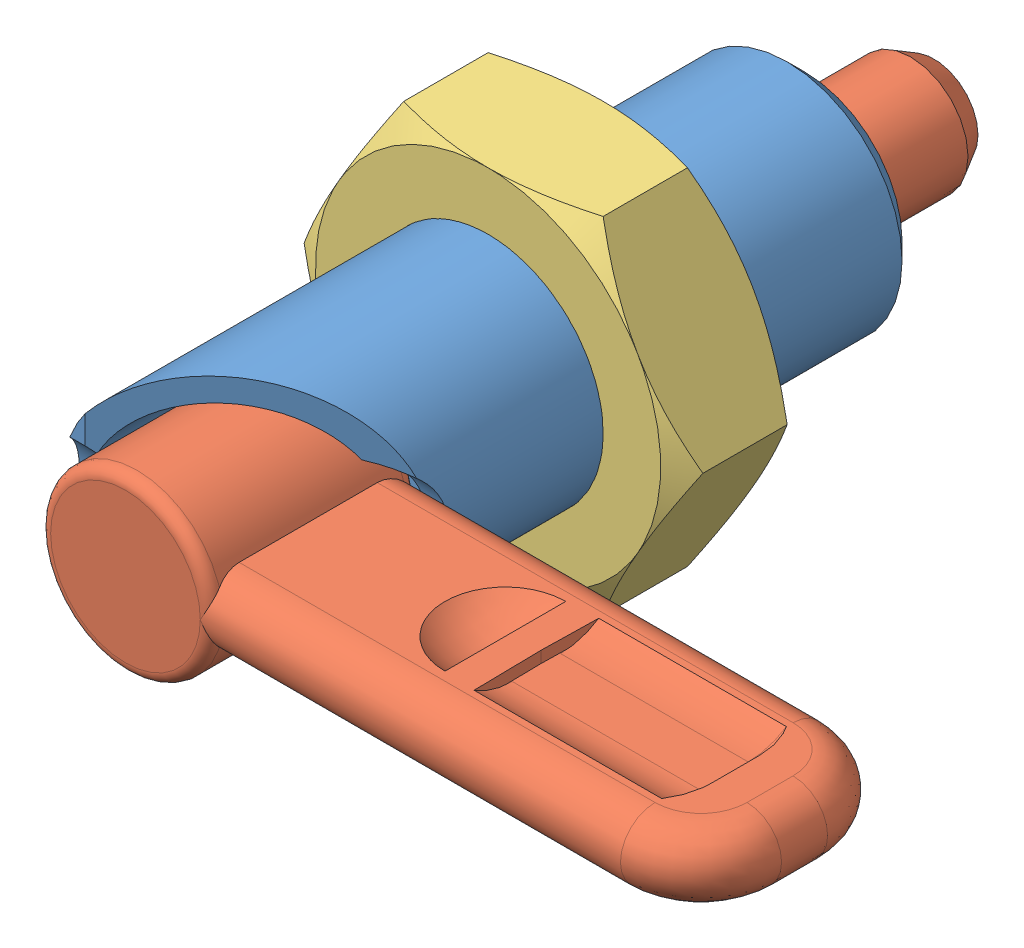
SolidWorks assembly GDX20LW-10N-SUS.sldasm, configuration Default (file format 15000). Lengths in mm.
Overall size (70.5 40.99 71).
3 component instances, 3 part files, 0 mates.
Components (placement in the parent):
- GDX20LW-10N-SUS_01-1: GDX20LW-10N-SUS_01.SLDPRT [ﾃﾞﾌｫﾙﾄ] x (1 0 0) z (0 -1 0) size (20.02 57.18 20.01)
- GDX20LW-10N-SUS_02-1: GDX20LW-10N-SUS_02.SLDPRT [ﾃﾞﾌｫﾙﾄ] x (1 0 0) z (0 -1 0) size (57.5 71 15)
- GDX20LW-10N-SUS_03-1: GDX20LW-10N-SUS_03.SLDPRT [ﾃﾞﾌｫﾙﾄ] at (0 0 17.5) x (0 0 1) z (0 1 0) size (10.01 40.99 40.99)
